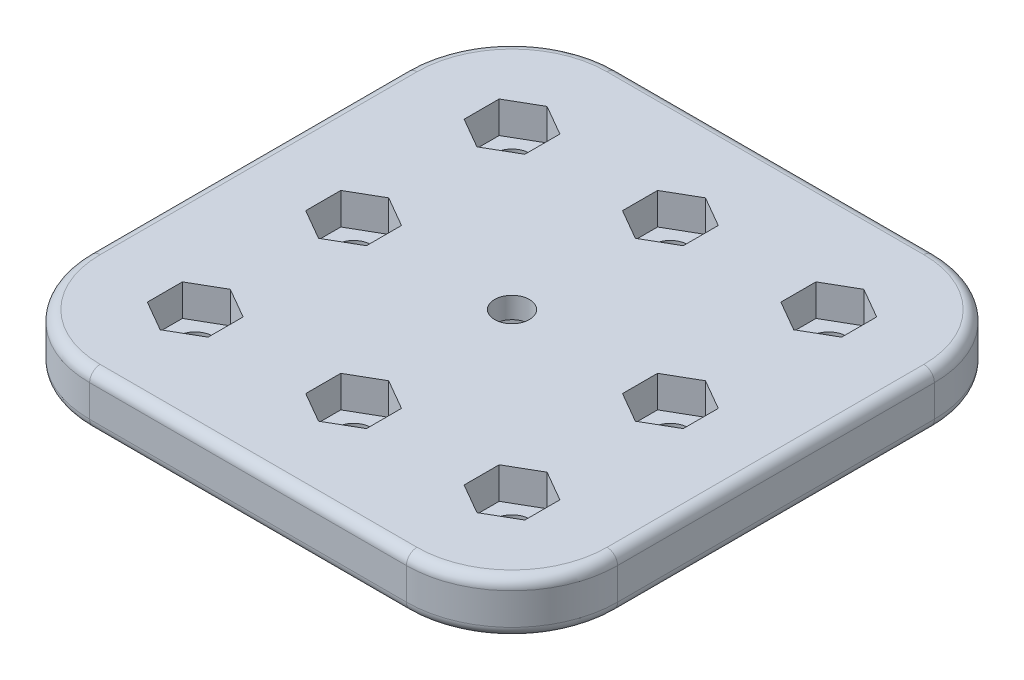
from build123d import *

# Parameters (mm, degrees)
SKETCH_1_W      = 50
SKETCH_1_H      = 50
EXTRUDE_1_DEPTH = 5
FILLET_1_R      = 10
FILLET_2_R      = 1
SKETCH_2_R      = 1.65
EXTRUDE_2_DEPTH = 2
SKETCH_3_R      = 1.65
EXTRUDE_3_DEPTH = 2


with BuildPart() as part:
    # Sketch 1 → Extrude 1 (new body)
    with BuildSketch(Plane(origin=(0, 0, 0), x_dir=(1, 0, 0), z_dir=(0, 1, 0))):
        Rectangle(SKETCH_1_W, SKETCH_1_H)
        Polygon((15, 18.319764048), (12.125, 16.659882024), (12.125, 13.340117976), (15, 11.680235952), (17.875, 13.340117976), (17.875, 16.659882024), align=None, mode=Mode.SUBTRACT)
        Polygon((0, -3.319764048), (2.875, -1.659882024), (2.875, 1.659882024), (0, 3.319764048), (-2.875, 1.659882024), (-2.875, -1.659882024), align=None, mode=Mode.SUBTRACT)
        Polygon((0, 11.680235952), (2.875, 13.340117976), (2.875, 16.659882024), (0, 18.319764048), (-2.875, 16.659882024), (-2.875, 13.340117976), align=None, mode=Mode.SUBTRACT)
        Polygon((15, 3.319764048), (12.125, 1.659882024), (12.125, -1.659882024), (15, -3.319764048), (17.875, -1.659882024), (17.875, 1.659882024), align=None, mode=Mode.SUBTRACT)
        Polygon((15, -11.680235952), (12.125, -13.340117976), (12.125, -16.659882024), (15, -18.319764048), (17.875, -16.659882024), (17.875, -13.340117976), align=None, mode=Mode.SUBTRACT)
        Polygon((0, -11.680235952), (-2.875, -13.340117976), (-2.875, -16.659882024), (0, -18.319764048), (2.875, -16.659882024), (2.875, -13.340117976), align=None, mode=Mode.SUBTRACT)
        Polygon((-17.875, 13.340117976), (-15, 11.680235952), (-12.125, 13.340117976), (-12.125, 16.659882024), (-15, 18.319764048), (-17.875, 16.659882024), align=None, mode=Mode.SUBTRACT)
        Polygon((-17.875, -1.659882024), (-15, -3.319764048), (-12.125, -1.659882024), (-12.125, 1.659882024), (-15, 3.319764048), (-17.875, 1.659882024), align=None, mode=Mode.SUBTRACT)
        Polygon((-17.875, -16.659882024), (-15, -18.319764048), (-12.125, -16.659882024), (-12.125, -13.340117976), (-15, -11.680235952), (-17.875, -13.340117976), align=None, mode=Mode.SUBTRACT)
    extrude(amount=EXTRUDE_1_DEPTH)

    # Fillet 1
    fillet_1_edges = [part.edges().sort_by_distance(p)[0] for p in [
        (25, 2.5, 25),
        (-25, 2.5, 25),
        (-25, 2.5, -25),
        (25, 2.5, -25),
    ]]
    fillet(fillet_1_edges, radius=FILLET_1_R)

    # Fillet 2
    fillet_2_edges = [part.edges().sort_by_distance(p)[0] for p in [
        (0, 0, -25),
        (0, 5, -25),
        (25, 0, 0),
        (0, 0, 25),
        (-25, 0, 0),
        (-22.071067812, 0, -22.071067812),
        (-22.071067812, 0, 22.071067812),
        (22.071067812, 0, 22.071067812),
        (22.071067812, 0, -22.071067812),
        (25, 5, 0),
        (-25, 5, 0),
        (0, 5, 25),
        (-22.071067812, 5, -22.071067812),
        (-22.071067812, 5, 22.071067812),
        (22.071067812, 5, 22.071067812),
        (22.071067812, 5, -22.071067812),
    ]]
    fillet(fillet_2_edges, radius=FILLET_2_R)

    # Sketch 2 → Extrude 2 (add)
    with BuildSketch(Plane(origin=(0, 5, 0), x_dir=(1, 0, 0), z_dir=(0, 1, 0))):
        Polygon((0, 5.5), (-4.763139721, 2.75), (-4.763139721, -2.75), (0, -5.5), (4.763139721, -2.75), (4.763139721, 2.75), align=None)
        with Locations(Location((0, 0, 0), (0, 0, 270))):
            Circle(SKETCH_2_R, mode=Mode.SUBTRACT)
    extrude(amount=-EXTRUDE_2_DEPTH)

    # Sketch 3 → Extrude 3 (add)
    # profile 1 of 8: a face of its own
    with BuildSketch(Plane.XZ):
        Polygon((0, 11.680235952), (2.875, 13.340117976), (2.875, 16.659882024), (0, 18.319764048), (-2.875, 16.659882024), (-2.875, 13.340117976), align=None)
        with Locations(Location((0, 15, 0), (0, 0, 270))):
            Circle(SKETCH_3_R, mode=Mode.SUBTRACT)
    # profile 2 of 8: a face of its own
    with BuildSketch(Plane.XZ):
        Polygon((-15, 18.319764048), (-17.875, 16.659882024), (-17.875, 13.340117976), (-15, 11.680235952), (-12.125, 13.340117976), (-12.125, 16.659882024), align=None)
        with Locations(Location((-15, 15, 0), (0, 0, 270))):
            Circle(SKETCH_3_R, mode=Mode.SUBTRACT)
    # profile 3 of 8: a face of its own
    with BuildSketch(Plane.XZ):
        Polygon((15, 11.680235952), (17.875, 13.340117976), (17.875, 16.659882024), (15, 18.319764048), (12.125, 16.659882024), (12.125, 13.340117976), align=None)
        with Locations(Location((15, 15, 0), (0, 0, 270))):
            Circle(SKETCH_3_R, mode=Mode.SUBTRACT)
    # profile 4 of 8: a face of its own
    with BuildSketch(Plane.XZ):
        Polygon((15, -3.319764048), (17.875, -1.659882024), (17.875, 1.659882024), (15, 3.319764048), (12.125, 1.659882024), (12.125, -1.659882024), align=None)
        with Locations(Location((15, 0, 0), (0, 0, 270))):
            Circle(SKETCH_3_R, mode=Mode.SUBTRACT)
    # profile 5 of 8: a face of its own
    with BuildSketch(Plane.XZ):
        Polygon((0, -18.319764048), (2.875, -16.659882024), (2.875, -13.340117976), (0, -11.680235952), (-2.875, -13.340117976), (-2.875, -16.659882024), align=None)
        with Locations(Location((0, -15, 0), (0, 0, 270))):
            Circle(SKETCH_3_R, mode=Mode.SUBTRACT)
    # profile 6 of 8: a face of its own
    with BuildSketch(Plane.XZ):
        Polygon((15, -18.319764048), (17.875, -16.659882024), (17.875, -13.340117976), (15, -11.680235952), (12.125, -13.340117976), (12.125, -16.659882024), align=None)
        with Locations(Location((15, -15, 0), (0, 0, 270))):
            Circle(SKETCH_3_R, mode=Mode.SUBTRACT)
    # profile 7 of 8: a face of its own
    with BuildSketch(Plane.XZ):
        Polygon((-15, -3.319764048), (-12.125, -1.659882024), (-12.125, 1.659882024), (-15, 3.319764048), (-17.875, 1.659882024), (-17.875, -1.659882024), align=None)
        with Locations(Location((-15, 0, 0), (0, 0, 270))):
            Circle(SKETCH_3_R, mode=Mode.SUBTRACT)
    # profile 8 of 8: a face of its own
    with BuildSketch(Plane.XZ):
        Polygon((-15, -18.319764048), (-12.125, -16.659882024), (-12.125, -13.340117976), (-15, -11.680235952), (-17.875, -13.340117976), (-17.875, -16.659882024), align=None)
        with Locations(Location((-15, -15, 0), (0, 0, 270))):
            Circle(SKETCH_3_R, mode=Mode.SUBTRACT)
    extrude(amount=-EXTRUDE_3_DEPTH)


solid = part.part
